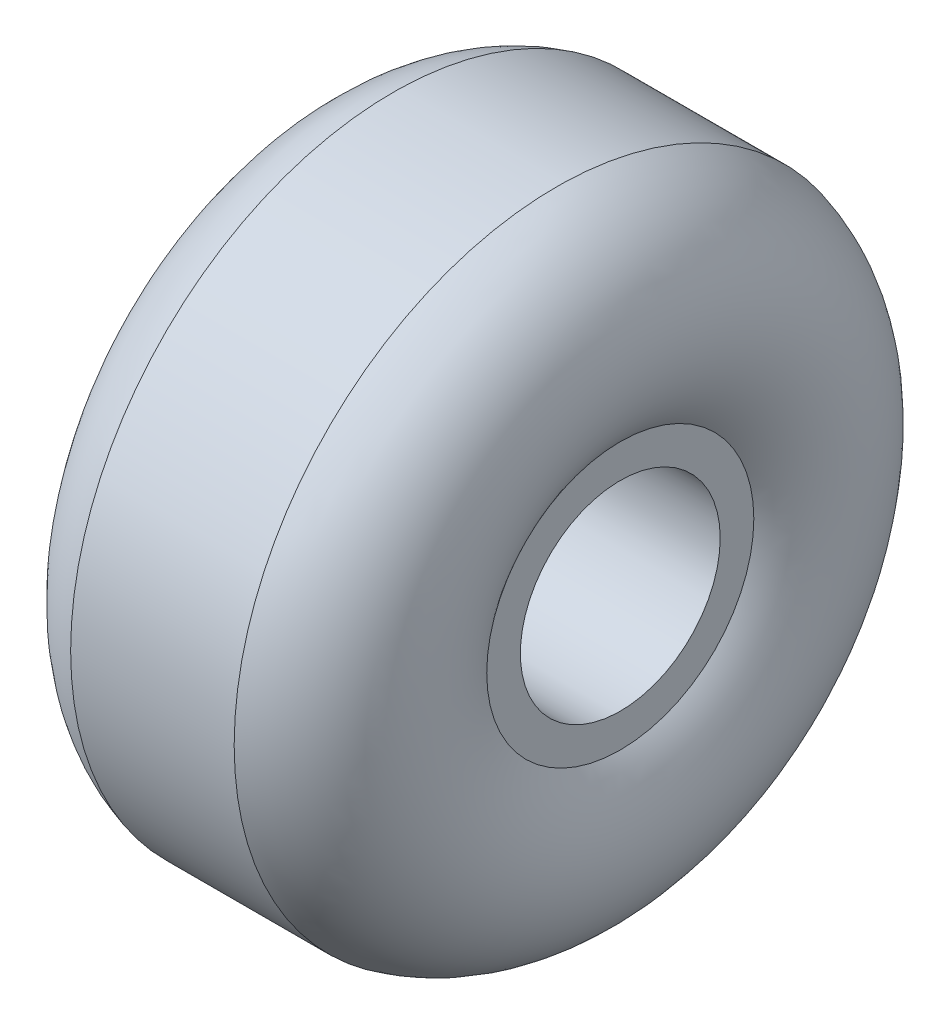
from build123d import *

# Parameters (mm, degrees)
SKETCH2_R          = 11
CUT_EXTRUDE1_DEPTH = 62.13961095


with BuildPart() as part:
    # Sketch1 → Revolve5 (revolve)
    with BuildSketch(Plane.XY, mode=Mode.PRIVATE) as revolve5_sk:
        with BuildLine():
            Line((-16, 0), (16, 0))
            Line((16, 0), (16, 14.7))
            ThreePointArc((16, 14.7), (18.214422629, 27.023123), (9, 35.5))
            Line((9, 35.5), (-9, 35.5))
            ThreePointArc((-9, 35.5), (-18.214422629, 27.023123), (-16, 14.7))
            Line((-16, 14.7), (-16, 0))
        make_face()
    revolve(revolve5_sk.sketch.rotate(Axis((-16, 0, 0), (1, 0, 0)), 90), axis=Axis((-16, 0, 0), (1, 0, 0)))

    # Sketch2 → Cut-Extrude1 (cut, through all)
    with BuildSketch(Plane(origin=(16, 0, 0), x_dir=(0, 0, -1), z_dir=(1, 0, 0))):
        Circle(SKETCH2_R)
    extrude(amount=-CUT_EXTRUDE1_DEPTH, mode=Mode.SUBTRACT)


solid = part.part
